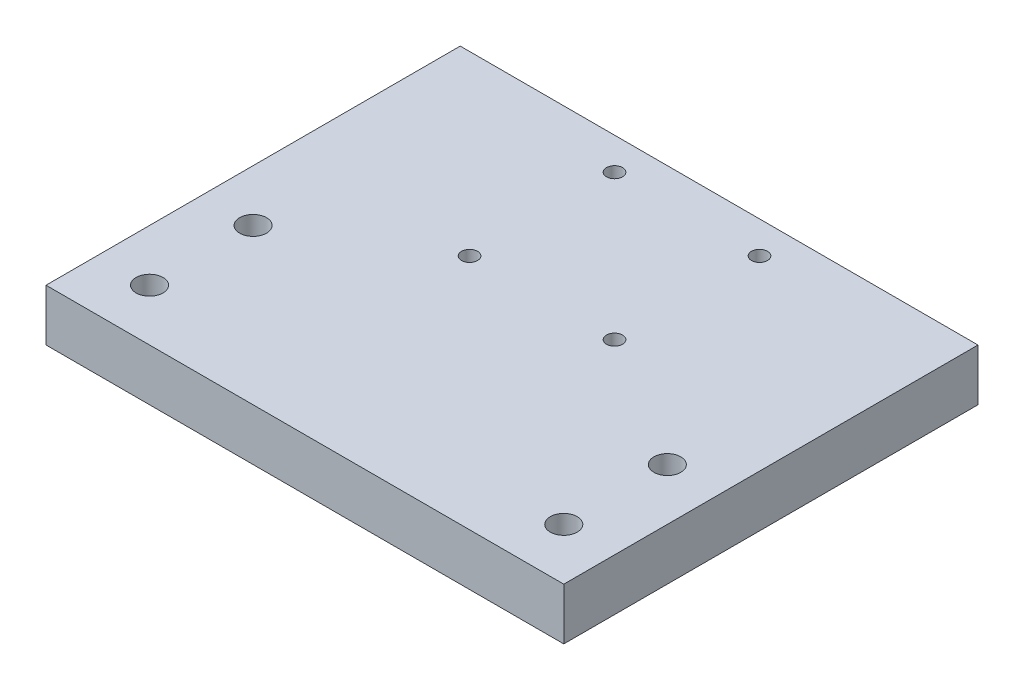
from build123d import *

# Parameters (mm, degrees)
SKETCH_1_W          = 100
SKETCH_1_H          = 80
EXTRUDE_1_DEPTH     = 10
SKETCH_3_R          = 2.6
CUT_EXTRUDE_2_DEPTH = 65.807406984
SKETCH_4_R          = 1.55
CUT_EXTRUDE_3_DEPTH = 65.807406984


with BuildPart() as part:
    # Sketch 1 → Extrude 1 (new body)
    with BuildSketch(Plane(origin=(0, 0, 0), x_dir=(1, 0, 0), z_dir=(0, 1, 0))):
        Rectangle(SKETCH_1_W, SKETCH_1_H)
    extrude(amount=EXTRUDE_1_DEPTH)

    # Sketch 3 → Cut-Extrude 2 (cut, through all)
    with BuildSketch(Plane.XZ):
        with Locations(Location((40, 30, 0), (0, 0, 270))):
            Circle(SKETCH_3_R)
        with Locations(Location((40, 10, 0), (0, 0, 270))):
            Circle(SKETCH_3_R)
        with Locations(Location((-40, 30, 0), (0, 0, 270))):
            Circle(SKETCH_3_R)
        with Locations(Location((-40, 10, 0), (0, 0, 270))):
            Circle(SKETCH_3_R)
    extrude(amount=-CUT_EXTRUDE_2_DEPTH, mode=Mode.SUBTRACT)

    # Sketch 4 → Cut-Extrude 3 (cut, through all)
    with BuildSketch(Plane(origin=(0, 10, 0), x_dir=(1, 0, 0), z_dir=(0, 1, 0))):
        with Locations(Location((14, 33.8, 0), (0, 0, 270))):
            Circle(SKETCH_4_R)
        with Locations(Location((14, 5.8, 0), (0, 0, 270))):
            Circle(SKETCH_4_R)
        with Locations(Location((-14, 33.8, 0), (0, 0, 270))):
            Circle(SKETCH_4_R)
        with Locations(Location((-14, 5.8, 0), (0, 0, 270))):
            Circle(SKETCH_4_R)
    extrude(amount=-CUT_EXTRUDE_3_DEPTH, mode=Mode.SUBTRACT)


solid = part.part
